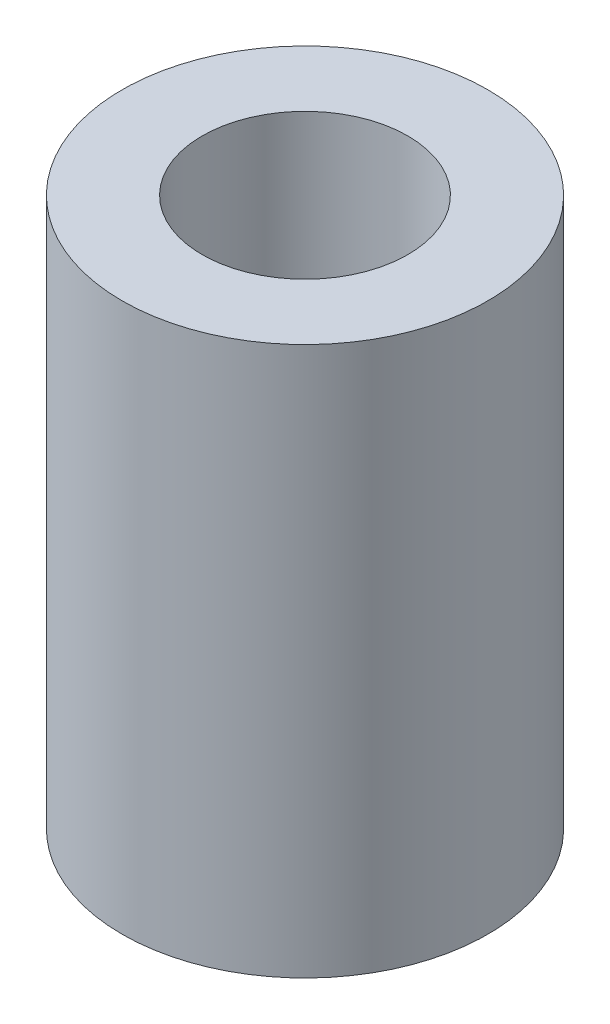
ISO-10303-21;
HEADER;
FILE_DESCRIPTION(('STEP AP214'),'2;1');
FILE_NAME('part.step','',(''),(''),'','','');
FILE_SCHEMA(('AUTOMOTIVE_DESIGN { 1 0 10303 214 1 1 1 1 }'));
ENDSEC;
DATA;
#1=APPLICATION_CONTEXT('core data for automotive mechanical design processes');
#2=APPLICATION_PROTOCOL_DEFINITION('international standard','automotive_design',2000,#1);
#3=PRODUCT_CONTEXT('',#1,'mechanical');
#4=PRODUCT('Part','Part','',(#3));
#5=PRODUCT_RELATED_PRODUCT_CATEGORY('part','',(#4));
#6=PRODUCT_DEFINITION_FORMATION('','',#4);
#7=PRODUCT_DEFINITION_CONTEXT('part definition',#1,'design');
#8=PRODUCT_DEFINITION('design','',#6,#7);
#9=PRODUCT_DEFINITION_SHAPE('','',#8);
#10=(LENGTH_UNIT() NAMED_UNIT(*) SI_UNIT(.MILLI.,.METRE.));
#11=(NAMED_UNIT(*) PLANE_ANGLE_UNIT() SI_UNIT($,.RADIAN.));
#12=(NAMED_UNIT(*) SI_UNIT($,.STERADIAN.) SOLID_ANGLE_UNIT());
#13=UNCERTAINTY_MEASURE_WITH_UNIT(LENGTH_MEASURE(1.E-05),#10,'distance_accuracy_value','');
#14=(GEOMETRIC_REPRESENTATION_CONTEXT(3) GLOBAL_UNCERTAINTY_ASSIGNED_CONTEXT((#13)) GLOBAL_UNIT_ASSIGNED_CONTEXT((#10,
#11,#12)) REPRESENTATION_CONTEXT('',''));
#15=CARTESIAN_POINT('',(0.,0.,0.));
#16=DIRECTION('',(0.,0.,1.));
#17=DIRECTION('',(1.,0.,0.));
#18=AXIS2_PLACEMENT_3D('',#15,#16,#17);
#19=CARTESIAN_POINT('',(0.,19.05,0.));
#20=DIRECTION('',(0.,1.,0.));
#21=DIRECTION('',(0.,0.,1.));
#22=AXIS2_PLACEMENT_3D('',#19,#20,#21);
#23=PLANE('',#22);
#24=CARTESIAN_POINT('',(0.,19.05,0.));
#25=DIRECTION('',(0.,1.,0.));
#26=DIRECTION('',(0.,0.,1.));
#27=AXIS2_PLACEMENT_3D('',#24,#25,#26);
#28=CIRCLE('',#27,6.35);
#29=CARTESIAN_POINT('',(0.,19.05,-6.35));
#30=VERTEX_POINT('',#29);
#31=EDGE_CURVE('E10',#30,#30,#28,.T.);
#32=ORIENTED_EDGE('',*,*,#31,.T.);
#33=EDGE_LOOP('',(#32));
#34=FACE_BOUND('',#33,.T.);
#35=CARTESIAN_POINT('',(0.,19.05,0.));
#36=DIRECTION('',(0.,1.,0.));
#37=DIRECTION('',(0.,0.,1.));
#38=AXIS2_PLACEMENT_3D('',#35,#36,#37);
#39=CIRCLE('',#38,3.571875);
#40=CARTESIAN_POINT('',(0.,19.05,-3.571875));
#41=VERTEX_POINT('',#40);
#42=EDGE_CURVE('E46',#41,#41,#39,.T.);
#43=ORIENTED_EDGE('',*,*,#42,.F.);
#44=EDGE_LOOP('',(#43));
#45=FACE_BOUND('',#44,.T.);
#46=ADVANCED_FACE('F35',(#34,#45),#23,.T.);
#47=CARTESIAN_POINT('',(0.,0.,0.));
#48=DIRECTION('',(0.,1.,0.));
#49=DIRECTION('',(0.,0.,1.));
#50=AXIS2_PLACEMENT_3D('',#47,#48,#49);
#51=PLANE('',#50);
#52=CARTESIAN_POINT('',(0.,0.,0.));
#53=DIRECTION('',(0.,1.,0.));
#54=DIRECTION('',(0.,0.,1.));
#55=AXIS2_PLACEMENT_3D('',#52,#53,#54);
#56=CIRCLE('',#55,6.35);
#57=CARTESIAN_POINT('',(0.,0.,-6.35));
#58=VERTEX_POINT('',#57);
#59=EDGE_CURVE('E39',#58,#58,#56,.T.);
#60=ORIENTED_EDGE('',*,*,#59,.F.);
#61=EDGE_LOOP('',(#60));
#62=FACE_BOUND('',#61,.T.);
#63=CARTESIAN_POINT('',(0.,0.,0.));
#64=DIRECTION('',(0.,1.,0.));
#65=DIRECTION('',(0.,0.,1.));
#66=AXIS2_PLACEMENT_3D('',#63,#64,#65);
#67=CIRCLE('',#66,3.571875);
#68=CARTESIAN_POINT('',(0.,0.,-3.571875));
#69=VERTEX_POINT('',#68);
#70=EDGE_CURVE('E48',#69,#69,#67,.T.);
#71=ORIENTED_EDGE('',*,*,#70,.T.);
#72=EDGE_LOOP('',(#71));
#73=FACE_BOUND('',#72,.T.);
#74=ADVANCED_FACE('F58',(#62,#73),#51,.F.);
#75=CARTESIAN_POINT('',(0.,19.05,0.));
#76=DIRECTION('',(0.,-1.,0.));
#77=DIRECTION('',(0.,0.,-1.));
#78=AXIS2_PLACEMENT_3D('',#75,#76,#77);
#79=CYLINDRICAL_SURFACE('',#78,6.35);
#80=CARTESIAN_POINT('',(0.,19.05,-6.35));
#81=CARTESIAN_POINT('',(0.,18.8515625,-6.35));
#82=CARTESIAN_POINT('',(0.,18.653125,-6.35));
#83=CARTESIAN_POINT('',(0.,18.25625,-6.35));
#84=CARTESIAN_POINT('',(0.,18.0578125,-6.35));
#85=CARTESIAN_POINT('',(0.,17.6609375,-6.35));
#86=CARTESIAN_POINT('',(0.,17.4625,-6.35));
#87=CARTESIAN_POINT('',(0.,17.065625,-6.35));
#88=CARTESIAN_POINT('',(0.,16.8671875,-6.35));
#89=CARTESIAN_POINT('',(0.,16.4703125,-6.35));
#90=CARTESIAN_POINT('',(0.,16.271875,-6.35));
#91=CARTESIAN_POINT('',(0.,15.875,-6.35));
#92=CARTESIAN_POINT('',(0.,15.6765625,-6.35));
#93=CARTESIAN_POINT('',(0.,15.2796875,-6.35));
#94=CARTESIAN_POINT('',(0.,15.08125,-6.35));
#95=CARTESIAN_POINT('',(0.,14.684375,-6.35));
#96=CARTESIAN_POINT('',(0.,14.4859375,-6.35));
#97=CARTESIAN_POINT('',(0.,14.0890625,-6.35));
#98=CARTESIAN_POINT('',(0.,13.890625,-6.35));
#99=CARTESIAN_POINT('',(0.,13.49375,-6.35));
#100=CARTESIAN_POINT('',(0.,13.2953125,-6.35));
#101=CARTESIAN_POINT('',(0.,12.8984375,-6.35));
#102=CARTESIAN_POINT('',(0.,12.7,-6.35));
#103=CARTESIAN_POINT('',(0.,12.303125,-6.35));
#104=CARTESIAN_POINT('',(0.,12.1046875,-6.35));
#105=CARTESIAN_POINT('',(0.,11.7078125,-6.35));
#106=CARTESIAN_POINT('',(0.,11.509375,-6.35));
#107=CARTESIAN_POINT('',(0.,11.1125,-6.35));
#108=CARTESIAN_POINT('',(0.,10.9140625,-6.35));
#109=CARTESIAN_POINT('',(0.,10.5171875,-6.35));
#110=CARTESIAN_POINT('',(0.,10.31875,-6.35));
#111=CARTESIAN_POINT('',(0.,9.921875,-6.35));
#112=CARTESIAN_POINT('',(0.,9.7234375,-6.35));
#113=CARTESIAN_POINT('',(0.,9.3265625,-6.35));
#114=CARTESIAN_POINT('',(0.,9.128125,-6.35));
#115=CARTESIAN_POINT('',(0.,8.73125,-6.35));
#116=CARTESIAN_POINT('',(0.,8.5328125,-6.35));
#117=CARTESIAN_POINT('',(0.,8.1359375,-6.35));
#118=CARTESIAN_POINT('',(0.,7.9375,-6.35));
#119=CARTESIAN_POINT('',(0.,7.540625,-6.35));
#120=CARTESIAN_POINT('',(0.,7.3421875,-6.35));
#121=CARTESIAN_POINT('',(0.,6.9453125,-6.35));
#122=CARTESIAN_POINT('',(0.,6.746875,-6.35));
#123=CARTESIAN_POINT('',(0.,6.35,-6.35));
#124=CARTESIAN_POINT('',(0.,6.1515625,-6.35));
#125=CARTESIAN_POINT('',(0.,5.7546875,-6.35));
#126=CARTESIAN_POINT('',(0.,5.55625,-6.35));
#127=CARTESIAN_POINT('',(0.,5.159375,-6.35));
#128=CARTESIAN_POINT('',(0.,4.9609375,-6.35));
#129=CARTESIAN_POINT('',(0.,4.5640625,-6.35));
#130=CARTESIAN_POINT('',(0.,4.365625,-6.35));
#131=CARTESIAN_POINT('',(0.,3.96875,-6.35));
#132=CARTESIAN_POINT('',(0.,3.7703125,-6.35));
#133=CARTESIAN_POINT('',(0.,3.3734375,-6.35));
#134=CARTESIAN_POINT('',(0.,3.175,-6.35));
#135=CARTESIAN_POINT('',(0.,2.778125,-6.35));
#136=CARTESIAN_POINT('',(0.,2.5796875,-6.35));
#137=CARTESIAN_POINT('',(0.,2.1828125,-6.35));
#138=CARTESIAN_POINT('',(0.,1.984375,-6.35));
#139=CARTESIAN_POINT('',(0.,1.5875,-6.35));
#140=CARTESIAN_POINT('',(0.,1.3890625,-6.35));
#141=CARTESIAN_POINT('',(0.,0.992187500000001,-6.35));
#142=CARTESIAN_POINT('',(0.,0.793750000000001,-6.35));
#143=CARTESIAN_POINT('',(0.,0.396875,-6.35));
#144=CARTESIAN_POINT('',(0.,0.1984375,-6.35));
#145=CARTESIAN_POINT('',(0.,0.,-6.35));
#146=B_SPLINE_CURVE_WITH_KNOTS('',3,(#80,#81,#82,#83,#84,#85,#86,#87,#88,#89,#90,#91,#92,#93,
#94,#95,#96,#97,#98,#99,#100,#101,#102,#103,#104,#105,#106,#107,#108,#109,#110,#111,#112,#113,
#114,#115,#116,#117,#118,#119,#120,#121,#122,#123,#124,#125,#126,#127,#128,#129,#130,#131,#132,
#133,#134,#135,#136,#137,#138,#139,#140,#141,#142,#143,#144,#145),.UNSPECIFIED.,.F.,.F.,(4,2,2,
2,2,2,2,2,2,2,2,2,2,2,2,2,2,2,2,2,2,2,2,2,2,2,2,2,2,2,2,2,4),(0.,0.5953125,1.190625,1.7859375,
2.38125,2.9765625,3.571875,4.1671875,4.7625,5.3578125,5.953125,6.5484375,7.14375,7.7390625,
8.334375,8.9296875,9.525,10.1203125,10.715625,11.3109375,11.90625,12.5015625,13.096875,
13.6921875,14.2875,14.8828125,15.478125,16.0734375,16.66875,17.2640625,17.859375,18.4546875,
19.05),.UNSPECIFIED.);
#147=EDGE_CURVE('BSEAM37',#30,#58,#146,.T.);
#148=ORIENTED_EDGE('',*,*,#31,.F.);
#149=ORIENTED_EDGE('',*,*,#59,.T.);
#150=ORIENTED_EDGE('',*,*,#147,.T.);
#151=ORIENTED_EDGE('',*,*,#147,.F.);
#152=EDGE_LOOP('',(#148,#150,#149,#151));
#153=FACE_BOUND('',#152,.T.);
#154=ADVANCED_FACE('F37',(#153),#79,.T.);
#155=CARTESIAN_POINT('',(0.,19.05,0.));
#156=DIRECTION('',(0.,-1.,0.));
#157=DIRECTION('',(0.,0.,-1.));
#158=AXIS2_PLACEMENT_3D('',#155,#156,#157);
#159=CYLINDRICAL_SURFACE('',#158,3.571875);
#160=CARTESIAN_POINT('',(0.,19.05,-3.571875));
#161=CARTESIAN_POINT('',(0.,18.8515625,-3.571875));
#162=CARTESIAN_POINT('',(0.,18.653125,-3.571875));
#163=CARTESIAN_POINT('',(0.,18.25625,-3.571875));
#164=CARTESIAN_POINT('',(0.,18.0578125,-3.571875));
#165=CARTESIAN_POINT('',(0.,17.6609375,-3.571875));
#166=CARTESIAN_POINT('',(0.,17.4625,-3.571875));
#167=CARTESIAN_POINT('',(0.,17.065625,-3.571875));
#168=CARTESIAN_POINT('',(0.,16.8671875,-3.571875));
#169=CARTESIAN_POINT('',(0.,16.4703125,-3.571875));
#170=CARTESIAN_POINT('',(0.,16.271875,-3.571875));
#171=CARTESIAN_POINT('',(0.,15.875,-3.571875));
#172=CARTESIAN_POINT('',(0.,15.6765625,-3.571875));
#173=CARTESIAN_POINT('',(0.,15.2796875,-3.571875));
#174=CARTESIAN_POINT('',(0.,15.08125,-3.571875));
#175=CARTESIAN_POINT('',(0.,14.684375,-3.571875));
#176=CARTESIAN_POINT('',(0.,14.4859375,-3.571875));
#177=CARTESIAN_POINT('',(0.,14.0890625,-3.571875));
#178=CARTESIAN_POINT('',(0.,13.890625,-3.571875));
#179=CARTESIAN_POINT('',(0.,13.49375,-3.571875));
#180=CARTESIAN_POINT('',(0.,13.2953125,-3.571875));
#181=CARTESIAN_POINT('',(0.,12.8984375,-3.571875));
#182=CARTESIAN_POINT('',(0.,12.7,-3.571875));
#183=CARTESIAN_POINT('',(0.,12.303125,-3.571875));
#184=CARTESIAN_POINT('',(0.,12.1046875,-3.571875));
#185=CARTESIAN_POINT('',(0.,11.7078125,-3.571875));
#186=CARTESIAN_POINT('',(0.,11.509375,-3.571875));
#187=CARTESIAN_POINT('',(0.,11.1125,-3.571875));
#188=CARTESIAN_POINT('',(0.,10.9140625,-3.571875));
#189=CARTESIAN_POINT('',(0.,10.5171875,-3.571875));
#190=CARTESIAN_POINT('',(0.,10.31875,-3.571875));
#191=CARTESIAN_POINT('',(0.,9.921875,-3.571875));
#192=CARTESIAN_POINT('',(0.,9.7234375,-3.571875));
#193=CARTESIAN_POINT('',(0.,9.3265625,-3.571875));
#194=CARTESIAN_POINT('',(0.,9.128125,-3.571875));
#195=CARTESIAN_POINT('',(0.,8.73125,-3.571875));
#196=CARTESIAN_POINT('',(0.,8.5328125,-3.571875));
#197=CARTESIAN_POINT('',(0.,8.1359375,-3.571875));
#198=CARTESIAN_POINT('',(0.,7.9375,-3.571875));
#199=CARTESIAN_POINT('',(0.,7.540625,-3.571875));
#200=CARTESIAN_POINT('',(0.,7.3421875,-3.571875));
#201=CARTESIAN_POINT('',(0.,6.9453125,-3.571875));
#202=CARTESIAN_POINT('',(0.,6.746875,-3.571875));
#203=CARTESIAN_POINT('',(0.,6.35,-3.571875));
#204=CARTESIAN_POINT('',(0.,6.1515625,-3.571875));
#205=CARTESIAN_POINT('',(0.,5.7546875,-3.571875));
#206=CARTESIAN_POINT('',(0.,5.55625,-3.571875));
#207=CARTESIAN_POINT('',(0.,5.159375,-3.571875));
#208=CARTESIAN_POINT('',(0.,4.9609375,-3.571875));
#209=CARTESIAN_POINT('',(0.,4.5640625,-3.571875));
#210=CARTESIAN_POINT('',(0.,4.365625,-3.571875));
#211=CARTESIAN_POINT('',(0.,3.96875,-3.571875));
#212=CARTESIAN_POINT('',(0.,3.7703125,-3.571875));
#213=CARTESIAN_POINT('',(0.,3.3734375,-3.571875));
#214=CARTESIAN_POINT('',(0.,3.175,-3.571875));
#215=CARTESIAN_POINT('',(0.,2.778125,-3.571875));
#216=CARTESIAN_POINT('',(0.,2.5796875,-3.571875));
#217=CARTESIAN_POINT('',(0.,2.1828125,-3.571875));
#218=CARTESIAN_POINT('',(0.,1.984375,-3.571875));
#219=CARTESIAN_POINT('',(0.,1.5875,-3.571875));
#220=CARTESIAN_POINT('',(0.,1.3890625,-3.571875));
#221=CARTESIAN_POINT('',(0.,0.992187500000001,-3.571875));
#222=CARTESIAN_POINT('',(0.,0.793750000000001,-3.571875));
#223=CARTESIAN_POINT('',(0.,0.396875,-3.571875));
#224=CARTESIAN_POINT('',(0.,0.1984375,-3.571875));
#225=CARTESIAN_POINT('',(0.,0.,-3.571875));
#226=B_SPLINE_CURVE_WITH_KNOTS('',3,(#160,#161,#162,#163,#164,#165,#166,#167,#168,#169,#170,
#171,#172,#173,#174,#175,#176,#177,#178,#179,#180,#181,#182,#183,#184,#185,#186,#187,#188,#189,
#190,#191,#192,#193,#194,#195,#196,#197,#198,#199,#200,#201,#202,#203,#204,#205,#206,#207,#208,
#209,#210,#211,#212,#213,#214,#215,#216,#217,#218,#219,#220,#221,#222,#223,#224,#225),
.UNSPECIFIED.,.F.,.F.,(4,2,2,2,2,2,2,2,2,2,2,2,2,2,2,2,2,2,2,2,2,2,2,2,2,2,2,2,2,2,2,2,4),(0.,
0.5953125,1.190625,1.7859375,2.38125,2.9765625,3.571875,4.1671875,4.7625,5.3578125,5.953125,
6.5484375,7.14375,7.7390625,8.334375,8.9296875,9.525,10.1203125,10.715625,11.3109375,11.90625,
12.5015625,13.096875,13.6921875,14.2875,14.8828125,15.478125,16.0734375,16.66875,17.2640625,
17.859375,18.4546875,19.05),.UNSPECIFIED.);
#227=EDGE_CURVE('BSEAM54',#41,#69,#226,.T.);
#228=ORIENTED_EDGE('',*,*,#42,.T.);
#229=ORIENTED_EDGE('',*,*,#70,.F.);
#230=ORIENTED_EDGE('',*,*,#227,.T.);
#231=ORIENTED_EDGE('',*,*,#227,.F.);
#232=EDGE_LOOP('',(#228,#230,#229,#231));
#233=FACE_BOUND('',#232,.T.);
#234=ADVANCED_FACE('F54',(#233),#159,.F.);
#235=CLOSED_SHELL('',(#46,#74,#154,#234));
#236=MANIFOLD_SOLID_BREP('B2',#235);
#237=ADVANCED_BREP_SHAPE_REPRESENTATION('',(#18,#236),#14);
#238=SHAPE_DEFINITION_REPRESENTATION(#9,#237);
ENDSEC;
END-ISO-10303-21;
